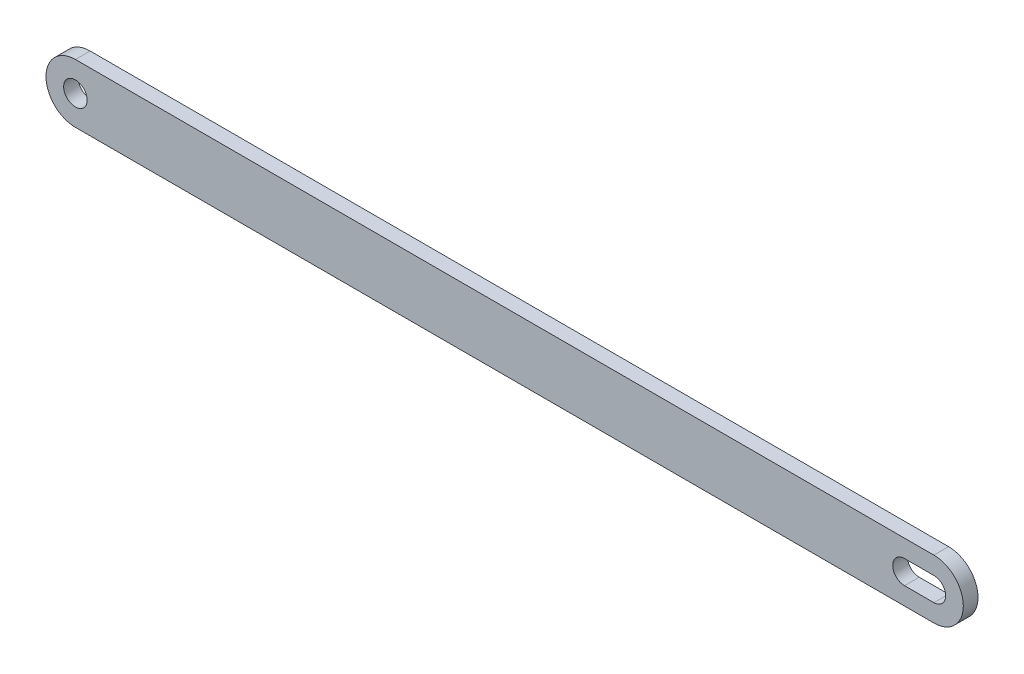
ISO-10303-21;
HEADER;
FILE_DESCRIPTION(('STEP AP214'),'2;1');
FILE_NAME('part.step','',(''),(''),'','','');
FILE_SCHEMA(('AUTOMOTIVE_DESIGN { 1 0 10303 214 1 1 1 1 }'));
ENDSEC;
DATA;
#1=APPLICATION_CONTEXT('core data for automotive mechanical design processes');
#2=APPLICATION_PROTOCOL_DEFINITION('international standard','automotive_design',2000,#1);
#3=PRODUCT_CONTEXT('',#1,'mechanical');
#4=PRODUCT('Part','Part','',(#3));
#5=PRODUCT_RELATED_PRODUCT_CATEGORY('part','',(#4));
#6=PRODUCT_DEFINITION_FORMATION('','',#4);
#7=PRODUCT_DEFINITION_CONTEXT('part definition',#1,'design');
#8=PRODUCT_DEFINITION('design','',#6,#7);
#9=PRODUCT_DEFINITION_SHAPE('','',#8);
#10=(LENGTH_UNIT() NAMED_UNIT(*) SI_UNIT(.MILLI.,.METRE.));
#11=(NAMED_UNIT(*) PLANE_ANGLE_UNIT() SI_UNIT($,.RADIAN.));
#12=(NAMED_UNIT(*) SI_UNIT($,.STERADIAN.) SOLID_ANGLE_UNIT());
#13=UNCERTAINTY_MEASURE_WITH_UNIT(LENGTH_MEASURE(1.E-05),#10,'distance_accuracy_value','');
#14=(GEOMETRIC_REPRESENTATION_CONTEXT(3) GLOBAL_UNCERTAINTY_ASSIGNED_CONTEXT((#13)) GLOBAL_UNIT_ASSIGNED_CONTEXT((#10,
#11,#12)) REPRESENTATION_CONTEXT('',''));
#15=CARTESIAN_POINT('',(0.,0.,0.));
#16=DIRECTION('',(0.,0.,1.));
#17=DIRECTION('',(1.,0.,0.));
#18=AXIS2_PLACEMENT_3D('',#15,#16,#17);
#19=CARTESIAN_POINT('',(-73.,0.,2.5));
#20=DIRECTION('',(0.,0.,-1.));
#21=DIRECTION('',(-1.,0.,0.));
#22=AXIS2_PLACEMENT_3D('',#19,#20,#21);
#23=CYLINDRICAL_SURFACE('',#22,5.);
#24=CARTESIAN_POINT('',(-73.,0.,0.));
#25=DIRECTION('',(0.,0.,1.));
#26=DIRECTION('',(-1.,0.,0.));
#27=AXIS2_PLACEMENT_3D('',#24,#25,#26);
#28=CIRCLE('',#27,5.);
#29=CARTESIAN_POINT('',(-73.,5.,0.));
#30=VERTEX_POINT('',#29);
#31=CARTESIAN_POINT('',(-73.,-5.,0.));
#32=VERTEX_POINT('',#31);
#33=EDGE_CURVE('E138',#30,#32,#28,.T.);
#34=ORIENTED_EDGE('',*,*,#33,.T.);
#35=DIRECTION('',(0.,0.,-1.));
#36=VECTOR('',#35,1.);
#37=CARTESIAN_POINT('',(-73.,-5.,2.5));
#38=LINE('',#37,#36);
#39=CARTESIAN_POINT('',(-73.,-5.,2.5));
#40=VERTEX_POINT('',#39);
#41=EDGE_CURVE('E11',#40,#32,#38,.T.);
#42=ORIENTED_EDGE('',*,*,#41,.F.);
#43=CARTESIAN_POINT('',(-73.,0.,2.5));
#44=DIRECTION('',(0.,0.,1.));
#45=DIRECTION('',(-1.,0.,0.));
#46=AXIS2_PLACEMENT_3D('',#43,#44,#45);
#47=CIRCLE('',#46,5.);
#48=CARTESIAN_POINT('',(-73.,5.,2.5));
#49=VERTEX_POINT('',#48);
#50=EDGE_CURVE('E141',#49,#40,#47,.T.);
#51=ORIENTED_EDGE('',*,*,#50,.F.);
#52=DIRECTION('',(0.,0.,-1.));
#53=VECTOR('',#52,1.);
#54=CARTESIAN_POINT('',(-73.,5.,2.5));
#55=LINE('',#54,#53);
#56=EDGE_CURVE('E151',#49,#30,#55,.T.);
#57=ORIENTED_EDGE('',*,*,#56,.T.);
#58=EDGE_LOOP('',(#34,#42,#51,#57));
#59=FACE_BOUND('',#58,.T.);
#60=ADVANCED_FACE('F34',(#59),#23,.T.);
#61=CARTESIAN_POINT('',(-73.,-5.,2.5));
#62=DIRECTION('',(0.,1.,0.));
#63=DIRECTION('',(0.,0.,1.));
#64=AXIS2_PLACEMENT_3D('',#61,#62,#63);
#65=PLANE('',#64);
#66=DIRECTION('',(1.,0.,0.));
#67=VECTOR('',#66,1.);
#68=CARTESIAN_POINT('',(-73.,-5.,0.));
#69=LINE('',#68,#67);
#70=CARTESIAN_POINT('',(73.,-5.,0.));
#71=VERTEX_POINT('',#70);
#72=EDGE_CURVE('E154',#32,#71,#69,.T.);
#73=ORIENTED_EDGE('',*,*,#72,.T.);
#74=DIRECTION('',(0.,0.,-1.));
#75=VECTOR('',#74,1.);
#76=CARTESIAN_POINT('',(73.,-5.,2.5));
#77=LINE('',#76,#75);
#78=CARTESIAN_POINT('',(73.,-5.,2.5));
#79=VERTEX_POINT('',#78);
#80=EDGE_CURVE('E41',#79,#71,#77,.T.);
#81=ORIENTED_EDGE('',*,*,#80,.F.);
#82=DIRECTION('',(1.,0.,0.));
#83=VECTOR('',#82,1.);
#84=CARTESIAN_POINT('',(-73.,-5.,2.5));
#85=LINE('',#84,#83);
#86=EDGE_CURVE('E144',#40,#79,#85,.T.);
#87=ORIENTED_EDGE('',*,*,#86,.F.);
#88=ORIENTED_EDGE('',*,*,#41,.T.);
#89=EDGE_LOOP('',(#73,#81,#87,#88));
#90=FACE_BOUND('',#89,.T.);
#91=ADVANCED_FACE('F183',(#90),#65,.F.);
#92=CARTESIAN_POINT('',(73.,0.,2.5));
#93=DIRECTION('',(0.,0.,-1.));
#94=DIRECTION('',(-1.,0.,0.));
#95=AXIS2_PLACEMENT_3D('',#92,#93,#94);
#96=CYLINDRICAL_SURFACE('',#95,5.);
#97=CARTESIAN_POINT('',(73.,0.,0.));
#98=DIRECTION('',(0.,0.,1.));
#99=DIRECTION('',(1.,0.,0.));
#100=AXIS2_PLACEMENT_3D('',#97,#98,#99);
#101=CIRCLE('',#100,5.);
#102=CARTESIAN_POINT('',(73.,4.99999999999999,0.));
#103=VERTEX_POINT('',#102);
#104=EDGE_CURVE('E156',#71,#103,#101,.T.);
#105=ORIENTED_EDGE('',*,*,#104,.T.);
#106=DIRECTION('',(0.,0.,-1.));
#107=VECTOR('',#106,1.);
#108=CARTESIAN_POINT('',(73.,4.99999999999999,2.5));
#109=LINE('',#108,#107);
#110=CARTESIAN_POINT('',(73.,4.99999999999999,2.5));
#111=VERTEX_POINT('',#110);
#112=EDGE_CURVE('E161',#111,#103,#109,.T.);
#113=ORIENTED_EDGE('',*,*,#112,.F.);
#114=CARTESIAN_POINT('',(73.,0.,2.5));
#115=DIRECTION('',(0.,0.,1.));
#116=DIRECTION('',(1.,0.,0.));
#117=AXIS2_PLACEMENT_3D('',#114,#115,#116);
#118=CIRCLE('',#117,5.);
#119=EDGE_CURVE('E147',#79,#111,#118,.T.);
#120=ORIENTED_EDGE('',*,*,#119,.F.);
#121=ORIENTED_EDGE('',*,*,#80,.T.);
#122=EDGE_LOOP('',(#105,#113,#120,#121));
#123=FACE_BOUND('',#122,.T.);
#124=ADVANCED_FACE('F168',(#123),#96,.T.);
#125=CARTESIAN_POINT('',(-73.,5.,2.5));
#126=DIRECTION('',(0.,-1.,0.));
#127=DIRECTION('',(0.,0.,-1.));
#128=AXIS2_PLACEMENT_3D('',#125,#126,#127);
#129=PLANE('',#128);
#130=DIRECTION('',(-1.,0.,0.));
#131=VECTOR('',#130,1.);
#132=CARTESIAN_POINT('',(-73.,5.,0.));
#133=LINE('',#132,#131);
#134=EDGE_CURVE('E145',#103,#30,#133,.T.);
#135=ORIENTED_EDGE('',*,*,#134,.T.);
#136=ORIENTED_EDGE('',*,*,#56,.F.);
#137=DIRECTION('',(-1.,0.,0.));
#138=VECTOR('',#137,1.);
#139=CARTESIAN_POINT('',(-73.,5.,2.5));
#140=LINE('',#139,#138);
#141=EDGE_CURVE('E149',#111,#49,#140,.T.);
#142=ORIENTED_EDGE('',*,*,#141,.F.);
#143=ORIENTED_EDGE('',*,*,#112,.T.);
#144=EDGE_LOOP('',(#135,#136,#142,#143));
#145=FACE_BOUND('',#144,.T.);
#146=ADVANCED_FACE('F176',(#145),#129,.F.);
#147=CARTESIAN_POINT('',(-73.,0.,2.5));
#148=DIRECTION('',(0.,0.,-1.));
#149=DIRECTION('',(-1.,0.,0.));
#150=AXIS2_PLACEMENT_3D('',#147,#148,#149);
#151=PLANE('',#150);
#152=DIRECTION('',(-1.,0.,0.));
#153=VECTOR('',#152,1.);
#154=CARTESIAN_POINT('',(73.,2.,2.5));
#155=LINE('',#154,#153);
#156=CARTESIAN_POINT('',(73.,2.,2.5));
#157=VERTEX_POINT('',#156);
#158=CARTESIAN_POINT('',(68.,2.,2.5));
#159=VERTEX_POINT('',#158);
#160=EDGE_CURVE('E125',#157,#159,#155,.T.);
#161=ORIENTED_EDGE('',*,*,#160,.F.);
#162=CARTESIAN_POINT('',(73.,0.,2.5));
#163=DIRECTION('',(0.,0.,1.));
#164=DIRECTION('',(-1.,0.,0.));
#165=AXIS2_PLACEMENT_3D('',#162,#163,#164);
#166=CIRCLE('',#165,2.);
#167=CARTESIAN_POINT('',(73.,-2.,2.5));
#168=VERTEX_POINT('',#167);
#169=EDGE_CURVE('E48',#168,#157,#166,.T.);
#170=ORIENTED_EDGE('',*,*,#169,.F.);
#171=DIRECTION('',(1.,0.,0.));
#172=VECTOR('',#171,1.);
#173=CARTESIAN_POINT('',(73.,-2.,2.5));
#174=LINE('',#173,#172);
#175=CARTESIAN_POINT('',(68.,-2.,2.5));
#176=VERTEX_POINT('',#175);
#177=EDGE_CURVE('E116',#176,#168,#174,.T.);
#178=ORIENTED_EDGE('',*,*,#177,.F.);
#179=CARTESIAN_POINT('',(68.,0.,2.5));
#180=DIRECTION('',(0.,0.,1.));
#181=DIRECTION('',(1.,0.,0.));
#182=AXIS2_PLACEMENT_3D('',#179,#180,#181);
#183=CIRCLE('',#182,2.);
#184=EDGE_CURVE('E119',#159,#176,#183,.T.);
#185=ORIENTED_EDGE('',*,*,#184,.F.);
#186=EDGE_LOOP('',(#161,#170,#178,#185));
#187=FACE_BOUND('',#186,.T.);
#188=CARTESIAN_POINT('',(-73.,0.,2.5));
#189=DIRECTION('',(0.,0.,1.));
#190=DIRECTION('',(1.,0.,0.));
#191=AXIS2_PLACEMENT_3D('',#188,#189,#190);
#192=CIRCLE('',#191,2.);
#193=CARTESIAN_POINT('',(-71.,0.,2.5));
#194=VERTEX_POINT('',#193);
#195=EDGE_CURVE('E131',#194,#194,#192,.T.);
#196=ORIENTED_EDGE('',*,*,#195,.F.);
#197=EDGE_LOOP('',(#196));
#198=FACE_BOUND('',#197,.T.);
#199=ORIENTED_EDGE('',*,*,#50,.T.);
#200=ORIENTED_EDGE('',*,*,#86,.T.);
#201=ORIENTED_EDGE('',*,*,#119,.T.);
#202=ORIENTED_EDGE('',*,*,#141,.T.);
#203=EDGE_LOOP('',(#199,#200,#201,#202));
#204=FACE_BOUND('',#203,.T.);
#205=ADVANCED_FACE('F182',(#187,#198,#204),#151,.F.);
#206=CARTESIAN_POINT('',(-73.,0.,0.));
#207=DIRECTION('',(0.,0.,-1.));
#208=DIRECTION('',(-1.,0.,0.));
#209=AXIS2_PLACEMENT_3D('',#206,#207,#208);
#210=PLANE('',#209);
#211=CARTESIAN_POINT('',(73.,0.,0.));
#212=DIRECTION('',(0.,0.,1.));
#213=DIRECTION('',(-1.,0.,0.));
#214=AXIS2_PLACEMENT_3D('',#211,#212,#213);
#215=CIRCLE('',#214,2.);
#216=CARTESIAN_POINT('',(73.,-2.,0.));
#217=VERTEX_POINT('',#216);
#218=CARTESIAN_POINT('',(73.,2.,0.));
#219=VERTEX_POINT('',#218);
#220=EDGE_CURVE('E100',#217,#219,#215,.T.);
#221=ORIENTED_EDGE('',*,*,#220,.T.);
#222=DIRECTION('',(-1.,0.,0.));
#223=VECTOR('',#222,1.);
#224=CARTESIAN_POINT('',(73.,2.,0.));
#225=LINE('',#224,#223);
#226=CARTESIAN_POINT('',(68.,2.,0.));
#227=VERTEX_POINT('',#226);
#228=EDGE_CURVE('E109',#219,#227,#225,.T.);
#229=ORIENTED_EDGE('',*,*,#228,.T.);
#230=CARTESIAN_POINT('',(68.,0.,0.));
#231=DIRECTION('',(0.,0.,1.));
#232=DIRECTION('',(1.,0.,0.));
#233=AXIS2_PLACEMENT_3D('',#230,#231,#232);
#234=CIRCLE('',#233,2.);
#235=CARTESIAN_POINT('',(68.,-2.,0.));
#236=VERTEX_POINT('',#235);
#237=EDGE_CURVE('E56',#227,#236,#234,.T.);
#238=ORIENTED_EDGE('',*,*,#237,.T.);
#239=DIRECTION('',(1.,0.,0.));
#240=VECTOR('',#239,1.);
#241=CARTESIAN_POINT('',(73.,-2.,0.));
#242=LINE('',#241,#240);
#243=EDGE_CURVE('E106',#236,#217,#242,.T.);
#244=ORIENTED_EDGE('',*,*,#243,.T.);
#245=EDGE_LOOP('',(#221,#229,#238,#244));
#246=FACE_BOUND('',#245,.T.);
#247=CARTESIAN_POINT('',(-73.,0.,0.));
#248=DIRECTION('',(0.,0.,1.));
#249=DIRECTION('',(1.,0.,0.));
#250=AXIS2_PLACEMENT_3D('',#247,#248,#249);
#251=CIRCLE('',#250,2.);
#252=CARTESIAN_POINT('',(-71.,0.,0.));
#253=VERTEX_POINT('',#252);
#254=EDGE_CURVE('E135',#253,#253,#251,.T.);
#255=ORIENTED_EDGE('',*,*,#254,.T.);
#256=EDGE_LOOP('',(#255));
#257=FACE_BOUND('',#256,.T.);
#258=ORIENTED_EDGE('',*,*,#33,.F.);
#259=ORIENTED_EDGE('',*,*,#134,.F.);
#260=ORIENTED_EDGE('',*,*,#104,.F.);
#261=ORIENTED_EDGE('',*,*,#72,.F.);
#262=EDGE_LOOP('',(#258,#259,#260,#261));
#263=FACE_BOUND('',#262,.T.);
#264=ADVANCED_FACE('F113',(#246,#257,#263),#210,.T.);
#265=CARTESIAN_POINT('',(-73.,0.,0.));
#266=DIRECTION('',(0.,0.,1.));
#267=DIRECTION('',(1.,0.,0.));
#268=AXIS2_PLACEMENT_3D('',#265,#266,#267);
#269=CYLINDRICAL_SURFACE('',#268,2.);
#270=ORIENTED_EDGE('',*,*,#254,.F.);
#271=EDGE_LOOP('',(#270));
#272=FACE_BOUND('',#271,.T.);
#273=ORIENTED_EDGE('',*,*,#195,.T.);
#274=EDGE_LOOP('',(#273));
#275=FACE_BOUND('',#274,.T.);
#276=ADVANCED_FACE('F195',(#272,#275),#269,.F.);
#277=CARTESIAN_POINT('',(73.,0.,0.));
#278=DIRECTION('',(0.,0.,1.));
#279=DIRECTION('',(1.,0.,0.));
#280=AXIS2_PLACEMENT_3D('',#277,#278,#279);
#281=CYLINDRICAL_SURFACE('',#280,2.);
#282=ORIENTED_EDGE('',*,*,#169,.T.);
#283=DIRECTION('',(0.,0.,1.));
#284=VECTOR('',#283,1.);
#285=CARTESIAN_POINT('',(73.,2.,0.));
#286=LINE('',#285,#284);
#287=EDGE_CURVE('E96',#219,#157,#286,.T.);
#288=ORIENTED_EDGE('',*,*,#287,.F.);
#289=ORIENTED_EDGE('',*,*,#220,.F.);
#290=DIRECTION('',(0.,0.,1.));
#291=VECTOR('',#290,1.);
#292=CARTESIAN_POINT('',(73.,-2.,0.));
#293=LINE('',#292,#291);
#294=EDGE_CURVE('E129',#217,#168,#293,.T.);
#295=ORIENTED_EDGE('',*,*,#294,.T.);
#296=EDGE_LOOP('',(#282,#288,#289,#295));
#297=FACE_BOUND('',#296,.T.);
#298=ADVANCED_FACE('F98',(#297),#281,.F.);
#299=CARTESIAN_POINT('',(73.,-2.,0.));
#300=DIRECTION('',(0.,-1.,0.));
#301=DIRECTION('',(1.,0.,0.));
#302=AXIS2_PLACEMENT_3D('',#299,#300,#301);
#303=PLANE('',#302);
#304=ORIENTED_EDGE('',*,*,#177,.T.);
#305=ORIENTED_EDGE('',*,*,#294,.F.);
#306=ORIENTED_EDGE('',*,*,#243,.F.);
#307=DIRECTION('',(0.,0.,1.));
#308=VECTOR('',#307,1.);
#309=CARTESIAN_POINT('',(68.,-2.,0.));
#310=LINE('',#309,#308);
#311=EDGE_CURVE('E132',#236,#176,#310,.T.);
#312=ORIENTED_EDGE('',*,*,#311,.T.);
#313=EDGE_LOOP('',(#304,#305,#306,#312));
#314=FACE_BOUND('',#313,.T.);
#315=ADVANCED_FACE('F204',(#314),#303,.F.);
#316=CARTESIAN_POINT('',(68.,0.,0.));
#317=DIRECTION('',(0.,0.,1.));
#318=DIRECTION('',(1.,0.,0.));
#319=AXIS2_PLACEMENT_3D('',#316,#317,#318);
#320=CYLINDRICAL_SURFACE('',#319,2.);
#321=ORIENTED_EDGE('',*,*,#184,.T.);
#322=ORIENTED_EDGE('',*,*,#311,.F.);
#323=ORIENTED_EDGE('',*,*,#237,.F.);
#324=DIRECTION('',(0.,0.,1.));
#325=VECTOR('',#324,1.);
#326=CARTESIAN_POINT('',(68.,2.,0.));
#327=LINE('',#326,#325);
#328=EDGE_CURVE('E105',#227,#159,#327,.T.);
#329=ORIENTED_EDGE('',*,*,#328,.T.);
#330=EDGE_LOOP('',(#321,#322,#323,#329));
#331=FACE_BOUND('',#330,.T.);
#332=ADVANCED_FACE('F207',(#331),#320,.F.);
#333=CARTESIAN_POINT('',(73.,2.,0.));
#334=DIRECTION('',(0.,1.,0.));
#335=DIRECTION('',(-1.,0.,0.));
#336=AXIS2_PLACEMENT_3D('',#333,#334,#335);
#337=PLANE('',#336);
#338=ORIENTED_EDGE('',*,*,#160,.T.);
#339=ORIENTED_EDGE('',*,*,#328,.F.);
#340=ORIENTED_EDGE('',*,*,#228,.F.);
#341=ORIENTED_EDGE('',*,*,#287,.T.);
#342=EDGE_LOOP('',(#338,#339,#340,#341));
#343=FACE_BOUND('',#342,.T.);
#344=ADVANCED_FACE('F110',(#343),#337,.F.);
#345=CLOSED_SHELL('',(#60,#91,#124,#146,#205,#264,#276,#298,#315,#332,#344));
#346=MANIFOLD_SOLID_BREP('B2',#345);
#347=ADVANCED_BREP_SHAPE_REPRESENTATION('',(#18,#346),#14);
#348=SHAPE_DEFINITION_REPRESENTATION(#9,#347);
ENDSEC;
END-ISO-10303-21;
